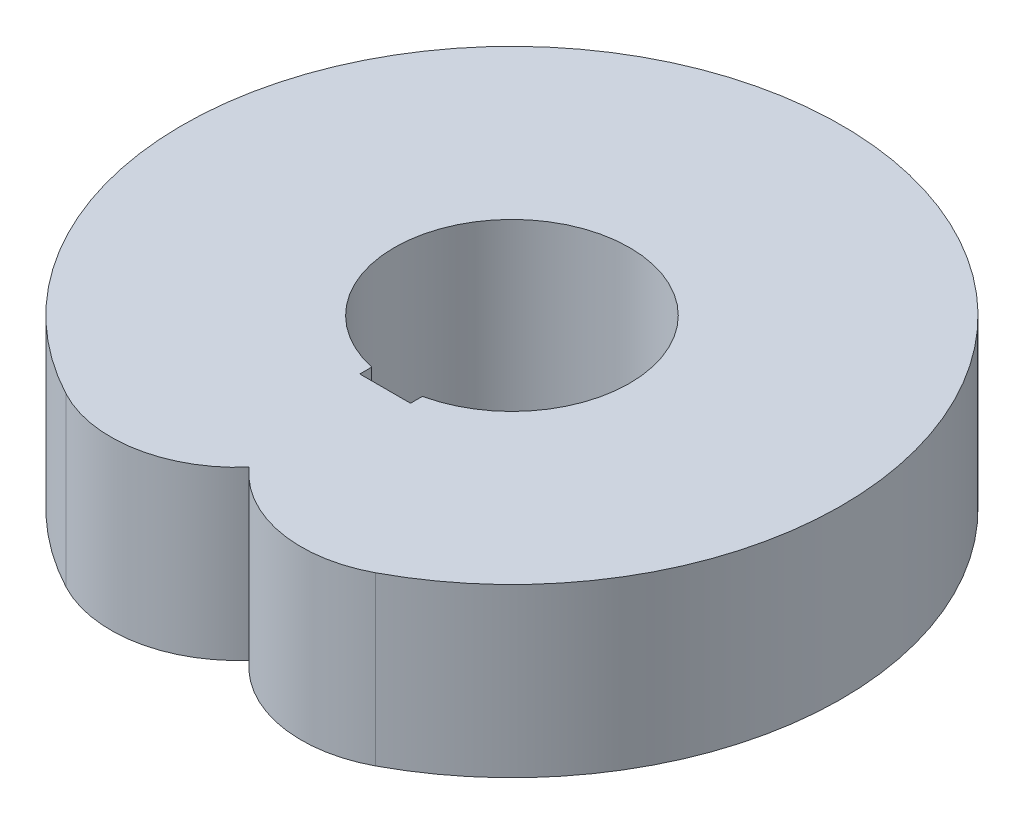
ISO-10303-21;
HEADER;
FILE_DESCRIPTION(('STEP AP214'),'2;1');
FILE_NAME('part.step','',(''),(''),'','','');
FILE_SCHEMA(('AUTOMOTIVE_DESIGN { 1 0 10303 214 1 1 1 1 }'));
ENDSEC;
DATA;
#1=APPLICATION_CONTEXT('core data for automotive mechanical design processes');
#2=APPLICATION_PROTOCOL_DEFINITION('international standard','automotive_design',2000,#1);
#3=PRODUCT_CONTEXT('',#1,'mechanical');
#4=PRODUCT('Part','Part','',(#3));
#5=PRODUCT_RELATED_PRODUCT_CATEGORY('part','',(#4));
#6=PRODUCT_DEFINITION_FORMATION('','',#4);
#7=PRODUCT_DEFINITION_CONTEXT('part definition',#1,'design');
#8=PRODUCT_DEFINITION('design','',#6,#7);
#9=PRODUCT_DEFINITION_SHAPE('','',#8);
#10=(LENGTH_UNIT() NAMED_UNIT(*) SI_UNIT(.MILLI.,.METRE.));
#11=(NAMED_UNIT(*) PLANE_ANGLE_UNIT() SI_UNIT($,.RADIAN.));
#12=(NAMED_UNIT(*) SI_UNIT($,.STERADIAN.) SOLID_ANGLE_UNIT());
#13=UNCERTAINTY_MEASURE_WITH_UNIT(LENGTH_MEASURE(1.E-05),#10,'distance_accuracy_value','');
#14=(GEOMETRIC_REPRESENTATION_CONTEXT(3) GLOBAL_UNCERTAINTY_ASSIGNED_CONTEXT((#13)) GLOBAL_UNIT_ASSIGNED_CONTEXT((#10,
#11,#12)) REPRESENTATION_CONTEXT('',''));
#15=CARTESIAN_POINT('',(0.,0.,0.));
#16=DIRECTION('',(0.,0.,1.));
#17=DIRECTION('',(1.,0.,0.));
#18=AXIS2_PLACEMENT_3D('',#15,#16,#17);
#19=CARTESIAN_POINT('',(93.8943125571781,0.,176.589518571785));
#20=DIRECTION('',(0.,1.,0.));
#21=DIRECTION('',(1.,0.,0.));
#22=AXIS2_PLACEMENT_3D('',#19,#20,#21);
#23=PLANE('',#22);
#24=CARTESIAN_POINT('',(187.788625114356,0.,353.17903714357));
#25=DIRECTION('',(0.,1.,0.));
#26=DIRECTION('',(1.,0.,0.));
#27=AXIS2_PLACEMENT_3D('',#24,#25,#26);
#28=CIRCLE('',#27,250.);
#29=CARTESIAN_POINT('',(0.,0.,518.210647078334));
#30=VERTEX_POINT('',#29);
#31=CARTESIAN_POINT('',(305.156515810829,0.,573.915935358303));
#32=VERTEX_POINT('',#31);
#33=EDGE_CURVE('E38',#30,#32,#28,.T.);
#34=ORIENTED_EDGE('',*,*,#33,.F.);
#35=CARTESIAN_POINT('',(-187.788625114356,0.,353.17903714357));
#36=DIRECTION('',(0.,1.,0.));
#37=DIRECTION('',(1.,0.,0.));
#38=AXIS2_PLACEMENT_3D('',#35,#36,#37);
#39=CIRCLE('',#38,250.);
#40=CARTESIAN_POINT('',(-305.156515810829,0.,573.915935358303));
#41=VERTEX_POINT('',#40);
#42=EDGE_CURVE('E147',#41,#30,#39,.T.);
#43=ORIENTED_EDGE('',*,*,#42,.F.);
#44=CARTESIAN_POINT('',(-2.22044604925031E-13,0.,0.));
#45=DIRECTION('',(0.,1.,0.));
#46=DIRECTION('',(1.,0.,0.));
#47=AXIS2_PLACEMENT_3D('',#44,#45,#46);
#48=CIRCLE('',#47,650.);
#49=EDGE_CURVE('E138',#32,#41,#48,.T.);
#50=ORIENTED_EDGE('',*,*,#49,.F.);
#51=EDGE_LOOP('',(#34,#43,#50));
#52=FACE_BOUND('',#51,.T.);
#53=DIRECTION('',(0.,0.,1.));
#54=VECTOR('',#53,1.);
#55=CARTESIAN_POINT('',(-50.,0.,0.));
#56=LINE('',#55,#54);
#57=CARTESIAN_POINT('',(-50.,0.,226.548008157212));
#58=VERTEX_POINT('',#57);
#59=CARTESIAN_POINT('',(-50.,0.,250.));
#60=VERTEX_POINT('',#59);
#61=EDGE_CURVE('E10',#58,#60,#56,.T.);
#62=ORIENTED_EDGE('',*,*,#61,.T.);
#63=DIRECTION('',(1.,0.,0.));
#64=VECTOR('',#63,1.);
#65=CARTESIAN_POINT('',(-50.,0.,250.));
#66=LINE('',#65,#64);
#67=CARTESIAN_POINT('',(50.,0.,250.));
#68=VERTEX_POINT('',#67);
#69=EDGE_CURVE('E25',#60,#68,#66,.T.);
#70=ORIENTED_EDGE('',*,*,#69,.T.);
#71=DIRECTION('',(0.,0.,-1.));
#72=VECTOR('',#71,1.);
#73=CARTESIAN_POINT('',(50.,0.,250.));
#74=LINE('',#73,#72);
#75=CARTESIAN_POINT('',(50.,0.,226.548008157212));
#76=VERTEX_POINT('',#75);
#77=EDGE_CURVE('E125',#68,#76,#74,.T.);
#78=ORIENTED_EDGE('',*,*,#77,.T.);
#79=CARTESIAN_POINT('',(0.,0.,0.));
#80=DIRECTION('',(0.,1.,0.));
#81=DIRECTION('',(1.,0.,0.));
#82=AXIS2_PLACEMENT_3D('',#79,#80,#81);
#83=CIRCLE('',#82,232.);
#84=EDGE_CURVE('E170',#76,#58,#83,.T.);
#85=ORIENTED_EDGE('',*,*,#84,.T.);
#86=EDGE_LOOP('',(#62,#70,#78,#85));
#87=FACE_BOUND('',#86,.T.);
#88=ADVANCED_FACE('F15',(#52,#87),#23,.F.);
#89=CARTESIAN_POINT('',(0.,330.,0.));
#90=DIRECTION('',(0.,1.,0.));
#91=DIRECTION('',(0.,0.,-1.));
#92=AXIS2_PLACEMENT_3D('',#89,#90,#91);
#93=CYLINDRICAL_SURFACE('',#92,232.);
#94=CARTESIAN_POINT('',(0.,330.,0.));
#95=DIRECTION('',(0.,1.,0.));
#96=DIRECTION('',(1.,0.,0.));
#97=AXIS2_PLACEMENT_3D('',#94,#95,#96);
#98=CIRCLE('',#97,232.);
#99=CARTESIAN_POINT('',(50.,330.,226.548008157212));
#100=VERTEX_POINT('',#99);
#101=CARTESIAN_POINT('',(-50.,330.,226.548008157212));
#102=VERTEX_POINT('',#101);
#103=EDGE_CURVE('E106',#100,#102,#98,.T.);
#104=ORIENTED_EDGE('',*,*,#103,.T.);
#105=DIRECTION('',(0.,-1.,0.));
#106=VECTOR('',#105,1.);
#107=CARTESIAN_POINT('',(-50.,330.,226.548008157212));
#108=LINE('',#107,#106);
#109=EDGE_CURVE('E159',#102,#58,#108,.T.);
#110=ORIENTED_EDGE('',*,*,#109,.T.);
#111=ORIENTED_EDGE('',*,*,#84,.F.);
#112=DIRECTION('',(0.,1.,0.));
#113=VECTOR('',#112,1.);
#114=CARTESIAN_POINT('',(50.,330.,226.548008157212));
#115=LINE('',#114,#113);
#116=EDGE_CURVE('E144',#76,#100,#115,.T.);
#117=ORIENTED_EDGE('',*,*,#116,.T.);
#118=EDGE_LOOP('',(#104,#110,#111,#117));
#119=FACE_BOUND('',#118,.T.);
#120=ADVANCED_FACE('F205',(#119),#93,.F.);
#121=CARTESIAN_POINT('',(93.8943125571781,330.,176.589518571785));
#122=DIRECTION('',(0.,1.,0.));
#123=DIRECTION('',(1.,0.,0.));
#124=AXIS2_PLACEMENT_3D('',#121,#122,#123);
#125=PLANE('',#124);
#126=CARTESIAN_POINT('',(187.788625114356,330.,353.17903714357));
#127=DIRECTION('',(0.,1.,0.));
#128=DIRECTION('',(1.,0.,0.));
#129=AXIS2_PLACEMENT_3D('',#126,#127,#128);
#130=CIRCLE('',#129,250.);
#131=CARTESIAN_POINT('',(0.,330.,518.210647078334));
#132=VERTEX_POINT('',#131);
#133=CARTESIAN_POINT('',(305.156515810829,330.,573.915935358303));
#134=VERTEX_POINT('',#133);
#135=EDGE_CURVE('E140',#132,#134,#130,.T.);
#136=ORIENTED_EDGE('',*,*,#135,.T.);
#137=CARTESIAN_POINT('',(-2.22044604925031E-13,330.,0.));
#138=DIRECTION('',(0.,1.,0.));
#139=DIRECTION('',(1.,0.,0.));
#140=AXIS2_PLACEMENT_3D('',#137,#138,#139);
#141=CIRCLE('',#140,650.);
#142=CARTESIAN_POINT('',(-305.156515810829,330.,573.915935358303));
#143=VERTEX_POINT('',#142);
#144=EDGE_CURVE('E75',#134,#143,#141,.T.);
#145=ORIENTED_EDGE('',*,*,#144,.T.);
#146=CARTESIAN_POINT('',(-187.788625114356,330.,353.17903714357));
#147=DIRECTION('',(0.,1.,0.));
#148=DIRECTION('',(1.,0.,0.));
#149=AXIS2_PLACEMENT_3D('',#146,#147,#148);
#150=CIRCLE('',#149,250.);
#151=EDGE_CURVE('E89',#143,#132,#150,.T.);
#152=ORIENTED_EDGE('',*,*,#151,.T.);
#153=EDGE_LOOP('',(#136,#145,#152));
#154=FACE_BOUND('',#153,.T.);
#155=DIRECTION('',(1.,0.,0.));
#156=VECTOR('',#155,1.);
#157=CARTESIAN_POINT('',(-50.,330.,250.));
#158=LINE('',#157,#156);
#159=CARTESIAN_POINT('',(-50.,330.,250.));
#160=VERTEX_POINT('',#159);
#161=CARTESIAN_POINT('',(50.,330.,250.));
#162=VERTEX_POINT('',#161);
#163=EDGE_CURVE('E103',#160,#162,#158,.T.);
#164=ORIENTED_EDGE('',*,*,#163,.F.);
#165=DIRECTION('',(0.,0.,1.));
#166=VECTOR('',#165,1.);
#167=CARTESIAN_POINT('',(-50.,330.,0.));
#168=LINE('',#167,#166);
#169=EDGE_CURVE('E168',#102,#160,#168,.T.);
#170=ORIENTED_EDGE('',*,*,#169,.F.);
#171=ORIENTED_EDGE('',*,*,#103,.F.);
#172=DIRECTION('',(0.,0.,-1.));
#173=VECTOR('',#172,1.);
#174=CARTESIAN_POINT('',(50.,330.,250.));
#175=LINE('',#174,#173);
#176=EDGE_CURVE('E99',#162,#100,#175,.T.);
#177=ORIENTED_EDGE('',*,*,#176,.F.);
#178=EDGE_LOOP('',(#164,#170,#171,#177));
#179=FACE_BOUND('',#178,.T.);
#180=ADVANCED_FACE('F101',(#154,#179),#125,.T.);
#181=CARTESIAN_POINT('',(-187.788625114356,330.,353.17903714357));
#182=DIRECTION('',(0.,1.,0.));
#183=DIRECTION('',(0.,0.,-1.));
#184=AXIS2_PLACEMENT_3D('',#181,#182,#183);
#185=CYLINDRICAL_SURFACE('',#184,250.);
#186=ORIENTED_EDGE('',*,*,#42,.T.);
#187=DIRECTION('',(0.,-1.,0.));
#188=VECTOR('',#187,1.);
#189=CARTESIAN_POINT('',(0.,330.,518.210647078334));
#190=LINE('',#189,#188);
#191=EDGE_CURVE('E164',#132,#30,#190,.T.);
#192=ORIENTED_EDGE('',*,*,#191,.F.);
#193=ORIENTED_EDGE('',*,*,#151,.F.);
#194=DIRECTION('',(0.,-1.,0.));
#195=VECTOR('',#194,1.);
#196=CARTESIAN_POINT('',(-305.156515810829,330.,573.915935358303));
#197=LINE('',#196,#195);
#198=EDGE_CURVE('E154',#143,#41,#197,.T.);
#199=ORIENTED_EDGE('',*,*,#198,.T.);
#200=EDGE_LOOP('',(#186,#192,#193,#199));
#201=FACE_BOUND('',#200,.T.);
#202=ADVANCED_FACE('F17',(#201),#185,.T.);
#203=CARTESIAN_POINT('',(-2.22044604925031E-13,330.,0.));
#204=DIRECTION('',(0.,1.,0.));
#205=DIRECTION('',(0.,0.,-1.));
#206=AXIS2_PLACEMENT_3D('',#203,#204,#205);
#207=CYLINDRICAL_SURFACE('',#206,650.);
#208=ORIENTED_EDGE('',*,*,#49,.T.);
#209=ORIENTED_EDGE('',*,*,#198,.F.);
#210=ORIENTED_EDGE('',*,*,#144,.F.);
#211=DIRECTION('',(0.,-1.,0.));
#212=VECTOR('',#211,1.);
#213=CARTESIAN_POINT('',(305.156515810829,330.,573.915935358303));
#214=LINE('',#213,#212);
#215=EDGE_CURVE('E136',#134,#32,#214,.T.);
#216=ORIENTED_EDGE('',*,*,#215,.T.);
#217=EDGE_LOOP('',(#208,#209,#210,#216));
#218=FACE_BOUND('',#217,.T.);
#219=ADVANCED_FACE('F198',(#218),#207,.T.);
#220=CARTESIAN_POINT('',(187.788625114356,330.,353.17903714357));
#221=DIRECTION('',(0.,1.,0.));
#222=DIRECTION('',(0.,0.,-1.));
#223=AXIS2_PLACEMENT_3D('',#220,#221,#222);
#224=CYLINDRICAL_SURFACE('',#223,250.);
#225=ORIENTED_EDGE('',*,*,#33,.T.);
#226=ORIENTED_EDGE('',*,*,#215,.F.);
#227=ORIENTED_EDGE('',*,*,#135,.F.);
#228=ORIENTED_EDGE('',*,*,#191,.T.);
#229=EDGE_LOOP('',(#225,#226,#227,#228));
#230=FACE_BOUND('',#229,.T.);
#231=ADVANCED_FACE('F224',(#230),#224,.T.);
#232=CARTESIAN_POINT('',(-50.,330.,0.));
#233=DIRECTION('',(1.,0.,0.));
#234=DIRECTION('',(0.,1.,0.));
#235=AXIS2_PLACEMENT_3D('',#232,#233,#234);
#236=PLANE('',#235);
#237=ORIENTED_EDGE('',*,*,#169,.T.);
#238=DIRECTION('',(0.,-1.,0.));
#239=VECTOR('',#238,1.);
#240=CARTESIAN_POINT('',(-50.,330.,250.));
#241=LINE('',#240,#239);
#242=EDGE_CURVE('E119',#160,#60,#241,.T.);
#243=ORIENTED_EDGE('',*,*,#242,.T.);
#244=ORIENTED_EDGE('',*,*,#61,.F.);
#245=ORIENTED_EDGE('',*,*,#109,.F.);
#246=EDGE_LOOP('',(#237,#243,#244,#245));
#247=FACE_BOUND('',#246,.T.);
#248=ADVANCED_FACE('F186',(#247),#236,.T.);
#249=CARTESIAN_POINT('',(-50.,330.,250.));
#250=DIRECTION('',(0.,0.,-1.));
#251=DIRECTION('',(0.,-1.,0.));
#252=AXIS2_PLACEMENT_3D('',#249,#250,#251);
#253=PLANE('',#252);
#254=ORIENTED_EDGE('',*,*,#69,.F.);
#255=ORIENTED_EDGE('',*,*,#242,.F.);
#256=ORIENTED_EDGE('',*,*,#163,.T.);
#257=DIRECTION('',(0.,-1.,0.));
#258=VECTOR('',#257,1.);
#259=CARTESIAN_POINT('',(50.,330.,250.));
#260=LINE('',#259,#258);
#261=EDGE_CURVE('E111',#162,#68,#260,.T.);
#262=ORIENTED_EDGE('',*,*,#261,.T.);
#263=EDGE_LOOP('',(#254,#255,#256,#262));
#264=FACE_BOUND('',#263,.T.);
#265=ADVANCED_FACE('F117',(#264),#253,.T.);
#266=CARTESIAN_POINT('',(50.,330.,250.));
#267=DIRECTION('',(-1.,0.,0.));
#268=DIRECTION('',(0.,0.,1.));
#269=AXIS2_PLACEMENT_3D('',#266,#267,#268);
#270=PLANE('',#269);
#271=ORIENTED_EDGE('',*,*,#77,.F.);
#272=ORIENTED_EDGE('',*,*,#261,.F.);
#273=ORIENTED_EDGE('',*,*,#176,.T.);
#274=ORIENTED_EDGE('',*,*,#116,.F.);
#275=EDGE_LOOP('',(#271,#272,#273,#274));
#276=FACE_BOUND('',#275,.T.);
#277=ADVANCED_FACE('F123',(#276),#270,.T.);
#278=CLOSED_SHELL('',(#88,#120,#180,#202,#219,#231,#248,#265,#277));
#279=MANIFOLD_SOLID_BREP('B1',#278);
#280=ADVANCED_BREP_SHAPE_REPRESENTATION('',(#18,#279),#14);
#281=SHAPE_DEFINITION_REPRESENTATION(#9,#280);
ENDSEC;
END-ISO-10303-21;
